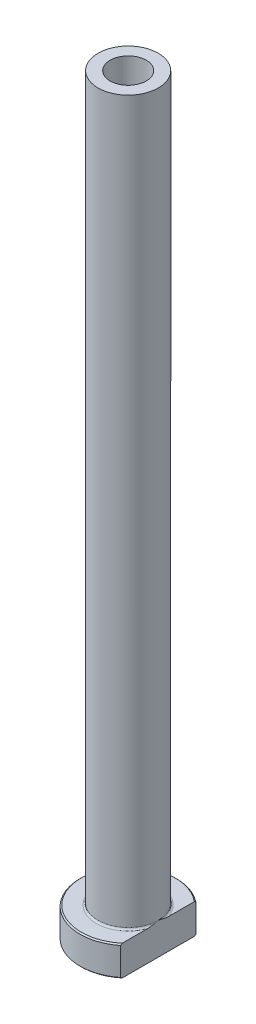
ISO-10303-21;
HEADER;
FILE_DESCRIPTION(('STEP AP214'),'2;1');
FILE_NAME('part.step','',(''),(''),'','','');
FILE_SCHEMA(('AUTOMOTIVE_DESIGN { 1 0 10303 214 1 1 1 1 }'));
ENDSEC;
DATA;
#1=APPLICATION_CONTEXT('core data for automotive mechanical design processes');
#2=APPLICATION_PROTOCOL_DEFINITION('international standard','automotive_design',2000,#1);
#3=PRODUCT_CONTEXT('',#1,'mechanical');
#4=PRODUCT('Part','Part','',(#3));
#5=PRODUCT_RELATED_PRODUCT_CATEGORY('part','',(#4));
#6=PRODUCT_DEFINITION_FORMATION('','',#4);
#7=PRODUCT_DEFINITION_CONTEXT('part definition',#1,'design');
#8=PRODUCT_DEFINITION('design','',#6,#7);
#9=PRODUCT_DEFINITION_SHAPE('','',#8);
#10=(LENGTH_UNIT() NAMED_UNIT(*) SI_UNIT(.MILLI.,.METRE.));
#11=(NAMED_UNIT(*) PLANE_ANGLE_UNIT() SI_UNIT($,.RADIAN.));
#12=(NAMED_UNIT(*) SI_UNIT($,.STERADIAN.) SOLID_ANGLE_UNIT());
#13=UNCERTAINTY_MEASURE_WITH_UNIT(LENGTH_MEASURE(1.E-05),#10,'distance_accuracy_value','');
#14=(GEOMETRIC_REPRESENTATION_CONTEXT(3) GLOBAL_UNCERTAINTY_ASSIGNED_CONTEXT((#13)) GLOBAL_UNIT_ASSIGNED_CONTEXT((#10,
#11,#12)) REPRESENTATION_CONTEXT('',''));
#15=CARTESIAN_POINT('',(0.,0.,0.));
#16=DIRECTION('',(0.,0.,1.));
#17=DIRECTION('',(1.,0.,0.));
#18=AXIS2_PLACEMENT_3D('',#15,#16,#17);
#19=CARTESIAN_POINT('',(0.,92.1876809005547,0.));
#20=DIRECTION('',(0.,1.,0.));
#21=DIRECTION('',(0.,0.,1.));
#22=AXIS2_PLACEMENT_3D('',#19,#20,#21);
#23=CYLINDRICAL_SURFACE('',#22,3.);
#24=CARTESIAN_POINT('',(0.,125.,0.));
#25=DIRECTION('',(0.,1.,0.));
#26=DIRECTION('',(0.,0.,1.));
#27=AXIS2_PLACEMENT_3D('',#24,#25,#26);
#28=CIRCLE('',#27,3.);
#29=CARTESIAN_POINT('',(0.,125.,3.));
#30=VERTEX_POINT('',#29);
#31=EDGE_CURVE('E167',#30,#30,#28,.T.);
#32=ORIENTED_EDGE('',*,*,#31,.T.);
#33=EDGE_LOOP('',(#32));
#34=FACE_BOUND('',#33,.T.);
#35=CARTESIAN_POINT('',(0.,80.,0.));
#36=DIRECTION('',(0.,1.,0.));
#37=DIRECTION('',(0.,0.,1.));
#38=AXIS2_PLACEMENT_3D('',#35,#36,#37);
#39=CIRCLE('',#38,3.);
#40=CARTESIAN_POINT('',(0.,80.,3.));
#41=VERTEX_POINT('',#40);
#42=EDGE_CURVE('E170',#41,#41,#39,.T.);
#43=ORIENTED_EDGE('',*,*,#42,.F.);
#44=EDGE_LOOP('',(#43));
#45=FACE_BOUND('',#44,.T.);
#46=ADVANCED_FACE('F32',(#34,#45),#23,.F.);
#47=CARTESIAN_POINT('',(-3.,125.,0.));
#48=DIRECTION('',(0.,1.,0.));
#49=DIRECTION('',(0.,0.,1.));
#50=AXIS2_PLACEMENT_3D('',#47,#48,#49);
#51=PLANE('',#50);
#52=CARTESIAN_POINT('',(0.,125.,0.));
#53=DIRECTION('',(0.,1.,0.));
#54=DIRECTION('',(0.,0.,1.));
#55=AXIS2_PLACEMENT_3D('',#52,#53,#54);
#56=CIRCLE('',#55,5.);
#57=CARTESIAN_POINT('',(0.,125.,5.));
#58=VERTEX_POINT('',#57);
#59=EDGE_CURVE('E174',#58,#58,#56,.T.);
#60=ORIENTED_EDGE('',*,*,#59,.T.);
#61=EDGE_LOOP('',(#60));
#62=FACE_BOUND('',#61,.T.);
#63=ORIENTED_EDGE('',*,*,#31,.F.);
#64=EDGE_LOOP('',(#63));
#65=FACE_BOUND('',#64,.T.);
#66=ADVANCED_FACE('F157',(#62,#65),#51,.T.);
#67=CARTESIAN_POINT('',(0.,92.1876809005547,0.));
#68=DIRECTION('',(0.,1.,0.));
#69=DIRECTION('',(0.,0.,1.));
#70=AXIS2_PLACEMENT_3D('',#67,#68,#69);
#71=CYLINDRICAL_SURFACE('',#70,5.);
#72=CARTESIAN_POINT('',(0.,5.3,0.));
#73=DIRECTION('',(0.,1.,0.));
#74=DIRECTION('',(0.,0.,1.));
#75=AXIS2_PLACEMENT_3D('',#72,#73,#74);
#76=CIRCLE('',#75,5.);
#77=CARTESIAN_POINT('',(5.,5.3,0.));
#78=VERTEX_POINT('',#77);
#79=EDGE_CURVE('E180',#78,#78,#76,.T.);
#80=ORIENTED_EDGE('',*,*,#79,.T.);
#81=EDGE_LOOP('',(#80));
#82=FACE_BOUND('',#81,.T.);
#83=ORIENTED_EDGE('',*,*,#59,.F.);
#84=EDGE_LOOP('',(#83));
#85=FACE_BOUND('',#84,.T.);
#86=ADVANCED_FACE('F162',(#82,#85),#71,.T.);
#87=CARTESIAN_POINT('',(-4.99999999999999,5.,0.));
#88=DIRECTION('',(0.,1.,0.));
#89=DIRECTION('',(0.,0.,1.));
#90=AXIS2_PLACEMENT_3D('',#87,#88,#89);
#91=PLANE('',#90);
#92=DIRECTION('',(0.,0.,1.));
#93=VECTOR('',#92,1.);
#94=CARTESIAN_POINT('',(5.,5.,0.));
#95=LINE('',#94,#93);
#96=CARTESIAN_POINT('',(5.,5.,-5.9866518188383));
#97=VERTEX_POINT('',#96);
#98=CARTESIAN_POINT('',(5.,5.,-1.7578395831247));
#99=VERTEX_POINT('',#98);
#100=EDGE_CURVE('E54',#97,#99,#95,.T.);
#101=ORIENTED_EDGE('',*,*,#100,.F.);
#102=CARTESIAN_POINT('',(0.,5.,0.));
#103=DIRECTION('',(0.,1.,0.));
#104=DIRECTION('',(0.,0.,1.));
#105=AXIS2_PLACEMENT_3D('',#102,#103,#104);
#106=CIRCLE('',#105,7.79999999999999);
#107=CARTESIAN_POINT('',(4.99999999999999,5.,5.9866518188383));
#108=VERTEX_POINT('',#107);
#109=EDGE_CURVE('E186',#97,#108,#106,.T.);
#110=ORIENTED_EDGE('',*,*,#109,.T.);
#111=CARTESIAN_POINT('',(5.,5.,1.7578395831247));
#112=VERTEX_POINT('',#111);
#113=EDGE_CURVE('E134',#112,#108,#95,.T.);
#114=ORIENTED_EDGE('',*,*,#113,.F.);
#115=CARTESIAN_POINT('',(0.,5.,0.));
#116=DIRECTION('',(0.,1.,0.));
#117=DIRECTION('',(0.,0.,1.));
#118=AXIS2_PLACEMENT_3D('',#115,#116,#117);
#119=CIRCLE('',#118,5.3);
#120=EDGE_CURVE('E183',#112,#99,#119,.F.);
#121=ORIENTED_EDGE('',*,*,#120,.T.);
#122=EDGE_LOOP('',(#101,#110,#114,#121));
#123=FACE_BOUND('',#122,.T.);
#124=ADVANCED_FACE('F197',(#123),#91,.T.);
#125=CARTESIAN_POINT('',(0.,92.1876809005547,0.));
#126=DIRECTION('',(0.,1.,0.));
#127=DIRECTION('',(0.,0.,1.));
#128=AXIS2_PLACEMENT_3D('',#125,#126,#127);
#129=CYLINDRICAL_SURFACE('',#128,7.99999999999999);
#130=DIRECTION('',(0.,-1.,0.));
#131=VECTOR('',#130,1.);
#132=CARTESIAN_POINT('',(4.99999999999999,125.,6.24499799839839));
#133=LINE('',#132,#131);
#134=CARTESIAN_POINT('',(4.99999999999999,4.8,6.24499799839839));
#135=VERTEX_POINT('',#134);
#136=CARTESIAN_POINT('',(4.99999999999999,0.20000000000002,6.24499799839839));
#137=VERTEX_POINT('',#136);
#138=EDGE_CURVE('E82',#135,#137,#133,.T.);
#139=ORIENTED_EDGE('',*,*,#138,.F.);
#140=CARTESIAN_POINT('',(0.,4.8,0.));
#141=DIRECTION('',(0.,1.,0.));
#142=DIRECTION('',(0.,0.,1.));
#143=AXIS2_PLACEMENT_3D('',#140,#141,#142);
#144=CIRCLE('',#143,7.99999999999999);
#145=CARTESIAN_POINT('',(5.,4.8,-6.24499799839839));
#146=VERTEX_POINT('',#145);
#147=EDGE_CURVE('E95',#135,#146,#144,.F.);
#148=ORIENTED_EDGE('',*,*,#147,.T.);
#149=DIRECTION('',(0.,-1.,0.));
#150=VECTOR('',#149,1.);
#151=CARTESIAN_POINT('',(5.,125.,-6.24499799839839));
#152=LINE('',#151,#150);
#153=CARTESIAN_POINT('',(5.,0.20000000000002,-6.24499799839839));
#154=VERTEX_POINT('',#153);
#155=EDGE_CURVE('E192',#146,#154,#152,.T.);
#156=ORIENTED_EDGE('',*,*,#155,.T.);
#157=CARTESIAN_POINT('',(0.,0.20000000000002,0.));
#158=DIRECTION('',(0.,-1.,0.));
#159=DIRECTION('',(0.,0.,-1.));
#160=AXIS2_PLACEMENT_3D('',#157,#158,#159);
#161=CIRCLE('',#160,7.99999999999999);
#162=EDGE_CURVE('E98',#154,#137,#161,.F.);
#163=ORIENTED_EDGE('',*,*,#162,.T.);
#164=EDGE_LOOP('',(#139,#148,#156,#163));
#165=FACE_BOUND('',#164,.T.);
#166=ADVANCED_FACE('F190',(#165),#129,.T.);
#167=CARTESIAN_POINT('',(-7.99999999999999,0.,0.));
#168=DIRECTION('',(0.,-1.,0.));
#169=DIRECTION('',(0.,0.,-1.));
#170=AXIS2_PLACEMENT_3D('',#167,#168,#169);
#171=PLANE('',#170);
#172=CARTESIAN_POINT('',(0.,0.,0.));
#173=DIRECTION('',(0.,-1.,0.));
#174=DIRECTION('',(0.,0.,-1.));
#175=AXIS2_PLACEMENT_3D('',#172,#173,#174);
#176=CIRCLE('',#175,3.74999999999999);
#177=CARTESIAN_POINT('',(0.,0.,-3.74999999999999));
#178=VERTEX_POINT('',#177);
#179=EDGE_CURVE('E40',#178,#178,#176,.F.);
#180=ORIENTED_EDGE('',*,*,#179,.T.);
#181=EDGE_LOOP('',(#180));
#182=FACE_BOUND('',#181,.T.);
#183=DIRECTION('',(0.,0.,-1.));
#184=VECTOR('',#183,1.);
#185=CARTESIAN_POINT('',(4.99999999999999,0.,6.24499799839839));
#186=LINE('',#185,#184);
#187=CARTESIAN_POINT('',(4.99999999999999,0.,5.98665181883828));
#188=VERTEX_POINT('',#187);
#189=CARTESIAN_POINT('',(5.,0.,-5.98665181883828));
#190=VERTEX_POINT('',#189);
#191=EDGE_CURVE('E47',#188,#190,#186,.T.);
#192=ORIENTED_EDGE('',*,*,#191,.F.);
#193=CARTESIAN_POINT('',(0.,0.,0.));
#194=DIRECTION('',(0.,-1.,0.));
#195=DIRECTION('',(0.,0.,-1.));
#196=AXIS2_PLACEMENT_3D('',#193,#194,#195);
#197=CIRCLE('',#196,7.79999999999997);
#198=EDGE_CURVE('E92',#188,#190,#197,.T.);
#199=ORIENTED_EDGE('',*,*,#198,.T.);
#200=EDGE_LOOP('',(#192,#199));
#201=FACE_BOUND('',#200,.T.);
#202=ADVANCED_FACE('F91',(#182,#201),#171,.T.);
#203=CARTESIAN_POINT('',(0.,92.1876809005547,0.));
#204=DIRECTION('',(0.,1.,0.));
#205=DIRECTION('',(0.,0.,1.));
#206=AXIS2_PLACEMENT_3D('',#203,#204,#205);
#207=CYLINDRICAL_SURFACE('',#206,3.24999999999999);
#208=CARTESIAN_POINT('',(0.,0.5,0.));
#209=DIRECTION('',(0.,-1.,0.));
#210=DIRECTION('',(0.,0.,-1.));
#211=AXIS2_PLACEMENT_3D('',#208,#209,#210);
#212=CIRCLE('',#211,3.24999999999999);
#213=CARTESIAN_POINT('',(0.,0.5,-3.24999999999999));
#214=VERTEX_POINT('',#213);
#215=EDGE_CURVE('E11',#214,#214,#212,.T.);
#216=ORIENTED_EDGE('',*,*,#215,.T.);
#217=EDGE_LOOP('',(#216));
#218=FACE_BOUND('',#217,.T.);
#219=CARTESIAN_POINT('',(0.,68.,0.));
#220=DIRECTION('',(0.,1.,0.));
#221=DIRECTION('',(0.,0.,1.));
#222=AXIS2_PLACEMENT_3D('',#219,#220,#221);
#223=CIRCLE('',#222,3.25);
#224=CARTESIAN_POINT('',(0.,68.,3.25));
#225=VERTEX_POINT('',#224);
#226=EDGE_CURVE('E172',#225,#225,#223,.T.);
#227=ORIENTED_EDGE('',*,*,#226,.T.);
#228=EDGE_LOOP('',(#227));
#229=FACE_BOUND('',#228,.T.);
#230=ADVANCED_FACE('F215',(#218,#229),#207,.F.);
#231=CARTESIAN_POINT('',(0.,68.,0.));
#232=DIRECTION('',(0.,-1.,0.));
#233=DIRECTION('',(0.,0.,-1.));
#234=AXIS2_PLACEMENT_3D('',#231,#232,#233);
#235=CONICAL_SURFACE('',#234,3.25,0.0208303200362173);
#236=ORIENTED_EDGE('',*,*,#42,.T.);
#237=EDGE_LOOP('',(#236));
#238=FACE_BOUND('',#237,.T.);
#239=ORIENTED_EDGE('',*,*,#226,.F.);
#240=EDGE_LOOP('',(#239));
#241=FACE_BOUND('',#240,.T.);
#242=ADVANCED_FACE('F111',(#238,#241),#235,.F.);
#243=CARTESIAN_POINT('',(0.,5.3,0.));
#244=DIRECTION('',(0.,1.,0.));
#245=DIRECTION('',(0.,0.,1.));
#246=AXIS2_PLACEMENT_3D('',#243,#244,#245);
#247=TOROIDAL_SURFACE('',#246,5.3,0.3);
#248=ORIENTED_EDGE('',*,*,#120,.F.);
#249=CARTESIAN_POINT('',(5.,5.3,0.));
#250=CARTESIAN_POINT('',(5.,5.30000062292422,-1.31469087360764E-10));
#251=CARTESIAN_POINT('',(5.,5.30000124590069,2.52759255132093E-07));
#252=CARTESIAN_POINT('',(5.,5.30000240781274,9.47164419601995E-07));
#253=CARTESIAN_POINT('',(5.,5.30000293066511,1.40594046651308E-06));
#254=CARTESIAN_POINT('',(5.,5.30000402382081,2.50637618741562E-06));
#255=CARTESIAN_POINT('',(5.,5.30000457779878,3.16588923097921E-06));
#256=CARTESIAN_POINT('',(5.,5.3000055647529,4.52859982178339E-06));
#257=CARTESIAN_POINT('',(5.,5.30000600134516,5.22939463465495E-06));
#258=CARTESIAN_POINT('',(5.,5.30000763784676,7.96122010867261E-06));
#259=CARTESIAN_POINT('',(5.,5.30000875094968,1.00477412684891E-05));
#260=CARTESIAN_POINT('',(5.,5.30001056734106,1.41660877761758E-05));
#261=CARTESIAN_POINT('',(5.,5.30001129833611,1.61861787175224E-05));
#262=CARTESIAN_POINT('',(5.,5.30001439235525,2.47865746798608E-05));
#263=CARTESIAN_POINT('',(5.,5.30001672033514,3.13830291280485E-05));
#264=CARTESIAN_POINT('',(5.,5.30002012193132,4.38084229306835E-05));
#265=CARTESIAN_POINT('',(5.,5.3000213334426,4.95992746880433E-05));
#266=CARTESIAN_POINT('',(5.,5.30003020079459,9.27862626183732E-05));
#267=CARTESIAN_POINT('',(5.,5.30003696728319,0.00013030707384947));
#268=CARTESIAN_POINT('',(5.,5.30006659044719,0.000278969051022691));
#269=CARTESIAN_POINT('',(5.,5.30009481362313,0.000389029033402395));
#270=CARTESIAN_POINT('',(5.,5.30020506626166,0.000826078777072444));
#271=CARTESIAN_POINT('',(5.,5.30028365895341,0.00115365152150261));
#272=CARTESIAN_POINT('',(5.,5.30059919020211,0.00245925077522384));
#273=CARTESIAN_POINT('',(5.,5.30084048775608,0.00343651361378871));
#274=CARTESIAN_POINT('',(5.,5.30184626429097,0.00752058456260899));
#275=CARTESIAN_POINT('',(5.,5.30260525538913,0.0106283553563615));
#276=CARTESIAN_POINT('',(5.,5.3099646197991,0.0407482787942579));
#277=CARTESIAN_POINT('',(5.,5.31658985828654,0.0677561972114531));
#278=CARTESIAN_POINT('',(5.,5.32953319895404,0.120688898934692));
#279=CARTESIAN_POINT('',(5.,5.33585289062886,0.146613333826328));
#280=CARTESIAN_POINT('',(5.,5.34926050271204,0.20179565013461));
#281=CARTESIAN_POINT('',(5.,5.35634306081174,0.23105486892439));
#282=CARTESIAN_POINT('',(5.,5.37050252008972,0.289917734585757));
#283=CARTESIAN_POINT('',(5.,5.37757848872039,0.319521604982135));
#284=CARTESIAN_POINT('',(5.,5.39452602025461,0.391032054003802));
#285=CARTESIAN_POINT('',(5.,5.40434071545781,0.432952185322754));
#286=CARTESIAN_POINT('',(5.,5.42340141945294,0.515763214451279));
#287=CARTESIAN_POINT('',(5.,5.43265559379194,0.556652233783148));
#288=CARTESIAN_POINT('',(5.,5.45710553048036,0.667075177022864));
#289=CARTESIAN_POINT('',(5.,5.47194176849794,0.736689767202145));
#290=CARTESIAN_POINT('',(5.,5.5001822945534,0.876836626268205));
#291=CARTESIAN_POINT('',(5.,5.51357312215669,0.947371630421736));
#292=CARTESIAN_POINT('',(5.,5.53930921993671,1.09497328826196));
#293=CARTESIAN_POINT('',(5.,5.55146217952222,1.17207432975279));
#294=CARTESIAN_POINT('',(5.,5.57239669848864,1.32672649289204));
#295=CARTESIAN_POINT('',(5.,5.58117877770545,1.40427754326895));
#296=CARTESIAN_POINT('',(5.,5.59499725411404,1.5687382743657));
#297=CARTESIAN_POINT('',(5.,5.59948802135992,1.65570044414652));
#298=CARTESIAN_POINT('',(5.,5.60018885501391,1.7853530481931));
#299=CARTESIAN_POINT('',(5.,5.5994521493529,1.82802575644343));
#300=CARTESIAN_POINT('',(5.,5.59559364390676,1.91325081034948));
#301=CARTESIAN_POINT('',(5.,5.59247319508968,1.95580321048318));
#302=CARTESIAN_POINT('',(5.,5.58383242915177,2.03512365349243));
#303=CARTESIAN_POINT('',(5.,5.57867386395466,2.07192937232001));
#304=CARTESIAN_POINT('',(5.,5.56543793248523,2.14526756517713));
#305=CARTESIAN_POINT('',(5.,5.55734203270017,2.18179676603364));
#306=CARTESIAN_POINT('',(5.,5.53718005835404,2.25427226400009));
#307=CARTESIAN_POINT('',(5.,5.5250705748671,2.29020746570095));
#308=CARTESIAN_POINT('',(5.,5.50270928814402,2.34223029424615));
#309=CARTESIAN_POINT('',(5.,5.49457811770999,2.35922314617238));
#310=CARTESIAN_POINT('',(5.,5.47657809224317,2.39224900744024));
#311=CARTESIAN_POINT('',(5.,5.46671281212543,2.40828390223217));
#312=CARTESIAN_POINT('',(5.,5.44695893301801,2.43579467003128));
#313=CARTESIAN_POINT('',(5.,5.43745879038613,2.4475459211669));
#314=CARTESIAN_POINT('',(5.,5.41677914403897,2.4694647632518));
#315=CARTESIAN_POINT('',(5.,5.40560543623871,2.47963758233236));
#316=CARTESIAN_POINT('',(5.,5.38617750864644,2.49393642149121));
#317=CARTESIAN_POINT('',(5.,5.37851643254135,2.49886271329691));
#318=CARTESIAN_POINT('',(5.,5.36252740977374,2.50749953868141));
#319=CARTESIAN_POINT('',(5.,5.35419984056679,2.51121075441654));
#320=CARTESIAN_POINT('',(5.,5.33690648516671,2.51712941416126));
#321=CARTESIAN_POINT('',(5.,5.32793451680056,2.51931927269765));
#322=CARTESIAN_POINT('',(5.,5.30973576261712,2.52185978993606));
#323=CARTESIAN_POINT('',(5.,5.30050931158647,2.52221275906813));
#324=CARTESIAN_POINT('',(5.,5.28349166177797,2.52112455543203));
#325=CARTESIAN_POINT('',(5.,5.27568322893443,2.51993178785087));
#326=CARTESIAN_POINT('',(5.,5.26036860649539,2.5162829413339));
#327=CARTESIAN_POINT('',(5.,5.25286261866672,2.51382603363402));
#328=CARTESIAN_POINT('',(5.,5.23590266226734,2.50685484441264));
#329=CARTESIAN_POINT('',(5.,5.22661875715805,2.501929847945));
#330=CARTESIAN_POINT('',(5.,5.20895514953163,2.49066548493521));
#331=CARTESIAN_POINT('',(5.,5.20057756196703,2.48432291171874));
#332=CARTESIAN_POINT('',(5.,5.17987008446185,2.46645212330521));
#333=CARTESIAN_POINT('',(5.,5.16824151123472,2.45411867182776));
#334=CARTESIAN_POINT('',(5.,5.1469246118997,2.42790849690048));
#335=CARTESIAN_POINT('',(5.,5.1372398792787,2.4140289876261));
#336=CARTESIAN_POINT('',(5.,5.11080706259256,2.37143175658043));
#337=CARTESIAN_POINT('',(5.,5.0962877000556,2.34134703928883));
#338=CARTESIAN_POINT('',(5.,5.07130349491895,2.27940731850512));
#339=CARTESIAN_POINT('',(5.,5.0608711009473,2.24754035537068));
#340=CARTESIAN_POINT('',(5.,5.03890359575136,2.1678724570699));
#341=CARTESIAN_POINT('',(5.,5.02913523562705,2.1195906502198));
#342=CARTESIAN_POINT('',(5.,5.01416953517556,2.02224928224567));
#343=CARTESIAN_POINT('',(5.,5.00898637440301,1.97318778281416));
#344=CARTESIAN_POINT('',(5.,5.00220823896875,1.87635767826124));
#345=CARTESIAN_POINT('',(5.,5.00050709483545,1.82859609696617));
#346=CARTESIAN_POINT('',(5.,4.99969104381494,1.73330165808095));
#347=CARTESIAN_POINT('',(5.,5.00056327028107,1.68576884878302));
#348=CARTESIAN_POINT('',(5.,5.00484296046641,1.57937770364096));
#349=CARTESIAN_POINT('',(5.,5.00880932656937,1.5205428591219));
#350=CARTESIAN_POINT('',(5.,5.0192596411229,1.40312974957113));
#351=CARTESIAN_POINT('',(5.,5.02574264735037,1.34455139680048));
#352=CARTESIAN_POINT('',(5.,5.04090087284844,1.22627662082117));
#353=CARTESIAN_POINT('',(5.,5.04962425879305,1.16658647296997));
#354=CARTESIAN_POINT('',(5.,5.06877923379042,1.0473246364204));
#355=CARTESIAN_POINT('',(5.,5.07921523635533,0.987753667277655));
#356=CARTESIAN_POINT('',(5.,5.10551698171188,0.846936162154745));
#357=CARTESIAN_POINT('',(5.,5.12196565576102,0.765799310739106));
#358=CARTESIAN_POINT('',(5.,5.15639716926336,0.604819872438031));
#359=CARTESIAN_POINT('',(5.,5.17436050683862,0.524973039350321));
#360=CARTESIAN_POINT('',(5.,5.20921667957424,0.374726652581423));
#361=CARTESIAN_POINT('',(4.99999999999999,5.22599388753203,0.304300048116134));
#362=CARTESIAN_POINT('',(5.,5.2519110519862,0.196907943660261));
#363=CARTESIAN_POINT('',(5.,5.26090146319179,0.159905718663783));
#364=CARTESIAN_POINT('',(4.99999999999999,5.27881854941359,0.0865164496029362));
#365=CARTESIAN_POINT('',(4.99999999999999,5.28774391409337,0.0501291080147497));
#366=CARTESIAN_POINT('',(5.,5.29739627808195,0.0106218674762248));
#367=CARTESIAN_POINT('',(5.,5.2981568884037,0.0075076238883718));
#368=CARTESIAN_POINT('',(5.,5.29916304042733,0.00342209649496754));
#369=CARTESIAN_POINT('',(4.99999999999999,5.29940309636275,0.00244985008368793));
#370=CARTESIAN_POINT('',(5.,5.29971711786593,0.00115049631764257));
#371=CARTESIAN_POINT('',(5.,5.29979541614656,0.000824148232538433));
#372=CARTESIAN_POINT('',(5.,5.29990531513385,0.000388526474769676));
#373=CARTESIAN_POINT('',(5.,5.29993348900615,0.000278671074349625));
#374=CARTESIAN_POINT('',(5.,5.29996306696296,0.000130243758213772));
#375=CARTESIAN_POINT('',(5.,5.29996982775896,9.27511390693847E-05));
#376=CARTESIAN_POINT('',(5.,5.29997868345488,4.9592989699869E-05));
#377=CARTESIAN_POINT('',(5.,5.29997989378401,4.38036564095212E-05));
#378=CARTESIAN_POINT('',(5.,5.29998329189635,3.138141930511E-05));
#379=CARTESIAN_POINT('',(5.,5.29998561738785,2.4786522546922E-05));
#380=CARTESIAN_POINT('',(5.,5.29998870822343,1.61877550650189E-05));
#381=CARTESIAN_POINT('',(5.,5.29998943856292,1.4167777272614E-05));
#382=CARTESIAN_POINT('',(5.,5.2999912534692,1.00495534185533E-05));
#383=CARTESIAN_POINT('',(5.,5.2999923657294,7.96302685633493E-06));
#384=CARTESIAN_POINT('',(5.,5.29999400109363,5.23107434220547E-06));
#385=CARTESIAN_POINT('',(5.,5.29999443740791,4.5302105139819E-06));
#386=CARTESIAN_POINT('',(5.,5.29999542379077,3.16731170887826E-06));
#387=CARTESIAN_POINT('',(5.,5.299995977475,2.50767739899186E-06));
#388=CARTESIAN_POINT('',(5.,5.2999970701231,1.40695888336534E-06));
#389=CARTESIAN_POINT('',(5.,5.29999759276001,9.48032525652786E-07));
#390=CARTESIAN_POINT('',(5.,5.29999875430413,2.53244363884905E-07));
#391=CARTESIAN_POINT('',(5.,5.29999937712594,1.31459889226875E-10));
#392=CARTESIAN_POINT('',(5.,5.3,0.));
#393=B_SPLINE_CURVE_WITH_KNOTS('',3,(#249,#250,#251,#252,#253,#254,#255,#256,#257,#258,#259,
#260,#261,#262,#263,#264,#265,#266,#267,#268,#269,#270,#271,#272,#273,#274,#275,#276,#277,#278,
#279,#280,#281,#282,#283,#284,#285,#286,#287,#288,#289,#290,#291,#292,#293,#294,#295,#296,#297,
#298,#299,#300,#301,#302,#303,#304,#305,#306,#307,#308,#309,#310,#311,#312,#313,#314,#315,#316,
#317,#318,#319,#320,#321,#322,#323,#324,#325,#326,#327,#328,#329,#330,#331,#332,#333,#334,#335,
#336,#337,#338,#339,#340,#341,#342,#343,#344,#345,#346,#347,#348,#349,#350,#351,#352,#353,#354,
#355,#356,#357,#358,#359,#360,#361,#362,#363,#364,#365,#366,#367,#368,#369,#370,#371,#372,#373,
#374,#375,#376,#377,#378,#379,#380,#381,#382,#383,#384,#385,#386,#387,#388,#389,#390,#391,#392),
.UNSPECIFIED.,.T.,.F.,(4,2,2,2,2,2,2,2,2,2,2,2,2,2,2,2,2,2,2,2,2,2,2,2,2,2,2,2,2,2,2,2,2,2,2,2,
2,2,2,2,2,2,2,2,2,2,2,2,2,2,2,2,2,2,2,2,2,2,2,2,2,2,2,2,2,2,2,2,2,2,2,4),(0.,
1.88939263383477E-06,3.98058820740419E-06,6.54818442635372E-06,9.02404238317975E-06,
1.60938732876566E-05,2.25328176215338E-05,4.34843900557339E-05,6.12120172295E-05,
0.000175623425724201,0.000516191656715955,0.00152710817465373,0.00454656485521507,
0.0141443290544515,0.0975679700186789,0.177619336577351,0.267931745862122,0.35924502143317,
0.488405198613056,0.614173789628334,0.827694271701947,1.04305715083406,1.27715608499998,
1.51121890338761,1.77214751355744,1.90013509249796,2.02805018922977,2.13945459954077,
2.25157451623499,2.36494894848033,2.42139235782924,2.47772074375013,2.52293802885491,
2.56800219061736,2.59524342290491,2.62246933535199,2.65000494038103,2.67750590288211,
2.70108948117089,2.72468854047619,2.7560397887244,2.78746268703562,2.838028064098,
2.88868607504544,2.98834295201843,3.08877575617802,3.23618650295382,3.38405153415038,
3.52733651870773,3.66990630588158,3.84673903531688,4.02350562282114,4.20444776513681,
4.38586374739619,4.63419556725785,4.87971270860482,5.09690175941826,5.21113882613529,
5.32353360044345,5.33315137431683,5.33615533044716,5.33716246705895,5.33750240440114,
5.33761672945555,5.33763445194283,5.3376553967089,5.33766183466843,5.33766890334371,
5.33767137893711,5.33767394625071,5.33767603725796,5.33767792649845),.UNSPECIFIED.);
#394=EDGE_CURVE('E126',#112,#78,#393,.T.);
#395=ORIENTED_EDGE('',*,*,#394,.T.);
#396=ORIENTED_EDGE('',*,*,#79,.F.);
#397=CARTESIAN_POINT('',(5.,5.3,0.));
#398=CARTESIAN_POINT('',(5.,5.29999937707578,1.31470461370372E-10));
#399=CARTESIAN_POINT('',(5.,5.29999875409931,-2.52759253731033E-07));
#400=CARTESIAN_POINT('',(5.,5.29999759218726,-9.47164418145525E-07));
#401=CARTESIAN_POINT('',(5.,5.29999706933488,-1.40594046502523E-06));
#402=CARTESIAN_POINT('',(5.,5.29999597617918,-2.50637618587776E-06));
#403=CARTESIAN_POINT('',(5.,5.29999542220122,-3.16588922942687E-06));
#404=CARTESIAN_POINT('',(5.,5.2999944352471,-4.52859982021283E-06));
#405=CARTESIAN_POINT('',(5.,5.29999399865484,-5.22939463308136E-06));
#406=CARTESIAN_POINT('',(5.,5.29999236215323,-7.96122010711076E-06));
#407=CARTESIAN_POINT('',(5.,5.29999124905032,-1.00477412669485E-05));
#408=CARTESIAN_POINT('',(5.,5.29998943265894,-1.41660877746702E-05));
#409=CARTESIAN_POINT('',(5.,5.29998870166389,-1.61861787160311E-05));
#410=CARTESIAN_POINT('',(5.,5.29998560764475,-2.47865746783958E-05));
#411=CARTESIAN_POINT('',(5.,5.29998327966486,-3.13830291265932E-05));
#412=CARTESIAN_POINT('',(5.,5.29997987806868,-4.38084229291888E-05));
#413=CARTESIAN_POINT('',(5.,5.2999786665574,-4.95992746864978E-05));
#414=CARTESIAN_POINT('',(5.,5.29996979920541,-9.27862626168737E-05));
#415=CARTESIAN_POINT('',(5.,5.2999630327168,-0.000130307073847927));
#416=CARTESIAN_POINT('',(5.,5.2999334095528,-0.000278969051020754));
#417=CARTESIAN_POINT('',(5.,5.29990518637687,-0.000389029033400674));
#418=CARTESIAN_POINT('',(5.,5.29979493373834,-0.000826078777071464));
#419=CARTESIAN_POINT('',(5.,5.29971634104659,-0.00115365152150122));
#420=CARTESIAN_POINT('',(5.,5.29940080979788,-0.00245925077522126));
#421=CARTESIAN_POINT('',(5.,5.29915951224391,-0.00343651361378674));
#422=CARTESIAN_POINT('',(5.,5.29815373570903,-0.00752058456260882));
#423=CARTESIAN_POINT('',(5.,5.29739474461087,-0.0106283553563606));
#424=CARTESIAN_POINT('',(5.,5.29003538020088,-0.0407482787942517));
#425=CARTESIAN_POINT('',(5.,5.28341014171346,-0.0677561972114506));
#426=CARTESIAN_POINT('',(5.,5.27046680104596,-0.120688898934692));
#427=CARTESIAN_POINT('',(5.,5.26414710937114,-0.146613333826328));
#428=CARTESIAN_POINT('',(5.,5.25073949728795,-0.201795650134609));
#429=CARTESIAN_POINT('',(5.,5.24365693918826,-0.231054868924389));
#430=CARTESIAN_POINT('',(5.,5.22949747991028,-0.289917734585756));
#431=CARTESIAN_POINT('',(5.,5.22242151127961,-0.319521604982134));
#432=CARTESIAN_POINT('',(5.,5.20547397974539,-0.391032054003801));
#433=CARTESIAN_POINT('',(5.,5.19565928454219,-0.432952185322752));
#434=CARTESIAN_POINT('',(5.,5.17659858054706,-0.515763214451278));
#435=CARTESIAN_POINT('',(5.,5.16734440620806,-0.556652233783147));
#436=CARTESIAN_POINT('',(5.,5.14289446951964,-0.667075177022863));
#437=CARTESIAN_POINT('',(5.,5.12805823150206,-0.736689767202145));
#438=CARTESIAN_POINT('',(5.,5.0998177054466,-0.876836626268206));
#439=CARTESIAN_POINT('',(5.,5.08642687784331,-0.947371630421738));
#440=CARTESIAN_POINT('',(5.,5.06069078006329,-1.09497328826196));
#441=CARTESIAN_POINT('',(5.,5.04853782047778,-1.17207432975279));
#442=CARTESIAN_POINT('',(5.,5.02760330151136,-1.32672649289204));
#443=CARTESIAN_POINT('',(5.,5.01882122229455,-1.40427754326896));
#444=CARTESIAN_POINT('',(5.,5.00500274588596,-1.5687382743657));
#445=CARTESIAN_POINT('',(5.,5.00051197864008,-1.65570044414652));
#446=CARTESIAN_POINT('',(5.,4.99981114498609,-1.78535304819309));
#447=CARTESIAN_POINT('',(5.,5.0005478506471,-1.82802575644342));
#448=CARTESIAN_POINT('',(5.,5.00440635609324,-1.91325081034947));
#449=CARTESIAN_POINT('',(5.,5.00752680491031,-1.95580321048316));
#450=CARTESIAN_POINT('',(5.,5.01616757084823,-2.03512365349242));
#451=CARTESIAN_POINT('',(5.,5.02132613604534,-2.07192937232));
#452=CARTESIAN_POINT('',(5.,5.03456206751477,-2.14526756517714));
#453=CARTESIAN_POINT('',(5.,5.04265796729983,-2.18179676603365));
#454=CARTESIAN_POINT('',(5.,5.06281994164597,-2.25427226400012));
#455=CARTESIAN_POINT('',(5.,5.07492942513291,-2.29020746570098));
#456=CARTESIAN_POINT('',(5.,5.097290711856,-2.34223029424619));
#457=CARTESIAN_POINT('',(5.,5.10542188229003,-2.35922314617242));
#458=CARTESIAN_POINT('',(5.,5.12342190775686,-2.39224900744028));
#459=CARTESIAN_POINT('',(5.,5.1332871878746,-2.40828390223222));
#460=CARTESIAN_POINT('',(5.,5.15304106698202,-2.43579467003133));
#461=CARTESIAN_POINT('',(5.,5.16254120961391,-2.44754592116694));
#462=CARTESIAN_POINT('',(5.,5.18322085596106,-2.46946476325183));
#463=CARTESIAN_POINT('',(5.,5.19439456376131,-2.47963758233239));
#464=CARTESIAN_POINT('',(5.,5.21382249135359,-2.49393642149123));
#465=CARTESIAN_POINT('',(5.,5.22148356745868,-2.49886271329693));
#466=CARTESIAN_POINT('',(5.,5.23747259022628,-2.50749953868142));
#467=CARTESIAN_POINT('',(5.,5.24580015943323,-2.51121075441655));
#468=CARTESIAN_POINT('',(5.,5.26309351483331,-2.51712941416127));
#469=CARTESIAN_POINT('',(5.,5.27206548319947,-2.51931927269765));
#470=CARTESIAN_POINT('',(5.,5.2902642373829,-2.52185978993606));
#471=CARTESIAN_POINT('',(5.,5.29949068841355,-2.52221275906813));
#472=CARTESIAN_POINT('',(5.,5.31650833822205,-2.52112455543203));
#473=CARTESIAN_POINT('',(5.,5.32431677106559,-2.51993178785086));
#474=CARTESIAN_POINT('',(5.,5.33963139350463,-2.5162829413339));
#475=CARTESIAN_POINT('',(5.,5.3471373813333,-2.51382603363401));
#476=CARTESIAN_POINT('',(5.,5.36409733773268,-2.50685484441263));
#477=CARTESIAN_POINT('',(5.,5.37338124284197,-2.50192984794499));
#478=CARTESIAN_POINT('',(5.,5.39104485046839,-2.49066548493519));
#479=CARTESIAN_POINT('',(5.,5.39942243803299,-2.48432291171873));
#480=CARTESIAN_POINT('',(5.,5.42012991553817,-2.46645212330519));
#481=CARTESIAN_POINT('',(5.,5.4317584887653,-2.45411867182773));
#482=CARTESIAN_POINT('',(5.,5.45307538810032,-2.42790849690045));
#483=CARTESIAN_POINT('',(5.,5.46276012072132,-2.41402898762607));
#484=CARTESIAN_POINT('',(5.,5.48919293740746,-2.37143175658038));
#485=CARTESIAN_POINT('',(5.,5.50371229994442,-2.34134703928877));
#486=CARTESIAN_POINT('',(5.,5.52869650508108,-2.27940731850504));
#487=CARTESIAN_POINT('',(5.,5.53912889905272,-2.24754035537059));
#488=CARTESIAN_POINT('',(5.,5.56109640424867,-2.16787245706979));
#489=CARTESIAN_POINT('',(5.,5.57086476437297,-2.11959065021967));
#490=CARTESIAN_POINT('',(5.,5.58583046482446,-2.02224928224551));
#491=CARTESIAN_POINT('',(5.,5.59101362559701,-1.97318778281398));
#492=CARTESIAN_POINT('',(5.,5.59779176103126,-1.87635767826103));
#493=CARTESIAN_POINT('',(5.,5.59949290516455,-1.82859609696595));
#494=CARTESIAN_POINT('',(5.,5.60030895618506,-1.7333016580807));
#495=CARTESIAN_POINT('',(5.,5.59943672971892,-1.68576884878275));
#496=CARTESIAN_POINT('',(5.,5.59515703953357,-1.57937770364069));
#497=CARTESIAN_POINT('',(5.,5.59119067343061,-1.52054285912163));
#498=CARTESIAN_POINT('',(5.,5.58074035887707,-1.40312974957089));
#499=CARTESIAN_POINT('',(5.,5.5742573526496,-1.34455139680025));
#500=CARTESIAN_POINT('',(5.,5.55909912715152,-1.22627662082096));
#501=CARTESIAN_POINT('',(5.,5.55037574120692,-1.16658647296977));
#502=CARTESIAN_POINT('',(5.,5.53122076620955,-1.04732463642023));
#503=CARTESIAN_POINT('',(5.,5.52078476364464,-0.987753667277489));
#504=CARTESIAN_POINT('',(5.,5.49448301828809,-0.846936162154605));
#505=CARTESIAN_POINT('',(5.,5.47803434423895,-0.76579931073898));
#506=CARTESIAN_POINT('',(5.,5.44360283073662,-0.604819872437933));
#507=CARTESIAN_POINT('',(5.,5.42563949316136,-0.524973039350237));
#508=CARTESIAN_POINT('',(5.,5.39078332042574,-0.374726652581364));
#509=CARTESIAN_POINT('',(5.,5.37400611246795,-0.304300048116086));
#510=CARTESIAN_POINT('',(5.,5.3480889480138,-0.196907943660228));
#511=CARTESIAN_POINT('',(5.,5.33909853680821,-0.159905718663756));
#512=CARTESIAN_POINT('',(5.,5.3211814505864,-0.0865164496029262));
#513=CARTESIAN_POINT('',(5.,5.31225608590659,-0.050129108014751));
#514=CARTESIAN_POINT('',(5.,5.30260372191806,-0.0106218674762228));
#515=CARTESIAN_POINT('',(5.,5.3018431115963,-0.00750762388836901));
#516=CARTESIAN_POINT('',(5.,5.30083695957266,-0.00342209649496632));
#517=CARTESIAN_POINT('',(5.,5.30059690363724,-0.00244985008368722));
#518=CARTESIAN_POINT('',(5.,5.30028288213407,-0.00115049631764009));
#519=CARTESIAN_POINT('',(5.,5.30020458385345,-0.000824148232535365));
#520=CARTESIAN_POINT('',(5.,5.30009468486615,-0.000388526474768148));
#521=CARTESIAN_POINT('',(5.,5.30006651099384,-0.000278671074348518));
#522=CARTESIAN_POINT('',(5.,5.30003693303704,-0.000130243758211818));
#523=CARTESIAN_POINT('',(5.,5.30003017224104,-9.27511390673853E-05));
#524=CARTESIAN_POINT('',(5.,5.30002131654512,-4.95929896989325E-05));
#525=CARTESIAN_POINT('',(5.,5.30002010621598,-4.38036564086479E-05));
#526=CARTESIAN_POINT('',(5.,5.30001670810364,-3.13814193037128E-05));
#527=CARTESIAN_POINT('',(5.,5.30001438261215,-2.47865225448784E-05));
#528=CARTESIAN_POINT('',(5.,5.30001129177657,-1.61877550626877E-05));
#529=CARTESIAN_POINT('',(5.,5.30001056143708,-1.41677772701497E-05));
#530=CARTESIAN_POINT('',(5.,5.30000874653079,-1.00495534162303E-05));
#531=CARTESIAN_POINT('',(5.,5.3000076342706,-7.96302685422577E-06));
#532=CARTESIAN_POINT('',(5.,5.30000599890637,-5.23107433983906E-06));
#533=CARTESIAN_POINT('',(5.,5.30000556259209,-4.53021051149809E-06));
#534=CARTESIAN_POINT('',(5.,5.30000457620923,-3.16731170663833E-06));
#535=CARTESIAN_POINT('',(5.,5.30000402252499,-2.50767739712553E-06));
#536=CARTESIAN_POINT('',(5.,5.3000029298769,-1.40695888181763E-06));
#537=CARTESIAN_POINT('',(5.,5.30000240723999,-9.48032524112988E-07));
#538=CARTESIAN_POINT('',(5.,5.30000124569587,-2.5324436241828E-07));
#539=CARTESIAN_POINT('',(5.,5.30000062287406,-1.31458485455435E-10));
#540=CARTESIAN_POINT('',(5.,5.3,0.));
#541=B_SPLINE_CURVE_WITH_KNOTS('',3,(#397,#398,#399,#400,#401,#402,#403,#404,#405,#406,#407,
#408,#409,#410,#411,#412,#413,#414,#415,#416,#417,#418,#419,#420,#421,#422,#423,#424,#425,#426,
#427,#428,#429,#430,#431,#432,#433,#434,#435,#436,#437,#438,#439,#440,#441,#442,#443,#444,#445,
#446,#447,#448,#449,#450,#451,#452,#453,#454,#455,#456,#457,#458,#459,#460,#461,#462,#463,#464,
#465,#466,#467,#468,#469,#470,#471,#472,#473,#474,#475,#476,#477,#478,#479,#480,#481,#482,#483,
#484,#485,#486,#487,#488,#489,#490,#491,#492,#493,#494,#495,#496,#497,#498,#499,#500,#501,#502,
#503,#504,#505,#506,#507,#508,#509,#510,#511,#512,#513,#514,#515,#516,#517,#518,#519,#520,#521,
#522,#523,#524,#525,#526,#527,#528,#529,#530,#531,#532,#533,#534,#535,#536,#537,#538,#539,#540),
.UNSPECIFIED.,.T.,.F.,(4,2,2,2,2,2,2,2,2,2,2,2,2,2,2,2,2,2,2,2,2,2,2,2,2,2,2,2,2,2,2,2,2,2,2,2,
2,2,2,2,2,2,2,2,2,2,2,2,2,2,2,2,2,2,2,2,2,2,2,2,2,2,2,2,2,2,2,2,2,2,2,4),(0.,
1.88939263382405E-06,3.98058820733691E-06,6.54818442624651E-06,9.02404238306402E-06,
1.60938732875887E-05,2.25328176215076E-05,4.34843900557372E-05,6.12120172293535E-05,
0.000175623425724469,0.00051619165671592,0.00152710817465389,0.00454656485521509,
0.0141443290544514,0.0975679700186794,0.177619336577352,0.267931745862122,0.35924502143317,
0.488405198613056,0.614173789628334,0.827694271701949,1.04305715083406,1.27715608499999,
1.51121890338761,1.77214751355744,1.90013509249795,2.02805018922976,2.13945459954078,
2.25157451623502,2.36494894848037,2.42139235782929,2.47772074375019,2.52293802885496,
2.56800219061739,2.59524342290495,2.62246933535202,2.65000494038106,2.67750590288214,
2.70108948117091,2.72468854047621,2.75603978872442,2.78746268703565,2.83802806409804,
2.88868607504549,2.9883429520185,3.08877575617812,3.23618650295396,3.38405153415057,
3.52733651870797,3.66990630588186,3.84673903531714,4.02350562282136,4.204447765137,
4.38586374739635,4.63419556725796,4.87971270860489,5.09690175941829,5.2111388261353,
5.32353360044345,5.33315137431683,5.33615533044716,5.33716246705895,5.33750240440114,
5.33761672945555,5.33763445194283,5.3376553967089,5.33766183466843,5.33766890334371,
5.33767137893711,5.33767394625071,5.33767603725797,5.33767792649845),.UNSPECIFIED.);
#542=EDGE_CURVE('E135',#78,#99,#541,.T.);
#543=ORIENTED_EDGE('',*,*,#542,.T.);
#544=EDGE_LOOP('',(#248,#395,#396,#543));
#545=FACE_BOUND('',#544,.T.);
#546=ADVANCED_FACE('F141',(#545),#247,.F.);
#547=CARTESIAN_POINT('',(0.,5.,0.));
#548=DIRECTION('',(0.,-1.,0.));
#549=DIRECTION('',(0.,0.,-1.));
#550=AXIS2_PLACEMENT_3D('',#547,#548,#549);
#551=CONICAL_SURFACE('',#550,7.79999999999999,0.78539816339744);
#552=CARTESIAN_POINT('',(5.,-1.82162423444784,-13.7401563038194));
#553=CARTESIAN_POINT('',(5.,-1.61889813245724,-13.5244204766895));
#554=CARTESIAN_POINT('',(5.,-1.41646387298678,-13.3084101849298));
#555=CARTESIAN_POINT('',(5.,-1.0122765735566,-12.8757508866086));
#556=CARTESIAN_POINT('',(5.,-0.810523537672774,-12.6591018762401));
#557=CARTESIAN_POINT('',(5.,-0.206157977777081,-12.0077661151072));
#558=CARTESIAN_POINT('',(5.,0.19528061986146,-11.5719884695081));
#559=CARTESIAN_POINT('',(5.,1.00388282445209,-10.6856136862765));
#560=CARTESIAN_POINT('',(5.,1.41093902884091,-10.2349182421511));
#561=CARTESIAN_POINT('',(5.,2.01658324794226,-9.55471676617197));
#562=CARTESIAN_POINT('',(5.,2.21758236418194,-9.32735800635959));
#563=CARTESIAN_POINT('',(5.,2.61761142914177,-8.87091599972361));
#564=CARTESIAN_POINT('',(5.,2.81664139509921,-8.64183276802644));
#565=CARTESIAN_POINT('',(5.,3.21217345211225,-8.18170099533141));
#566=CARTESIAN_POINT('',(5.,3.40867681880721,-7.95065355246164));
#567=CARTESIAN_POINT('',(5.,3.79865427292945,-7.48599989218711));
#568=CARTESIAN_POINT('',(5.,3.99212827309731,-7.25239360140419));
#569=CARTESIAN_POINT('',(5.,4.37558160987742,-6.78155890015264));
#570=CARTESIAN_POINT('',(5.,4.56555334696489,-6.54432428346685));
#571=CARTESIAN_POINT('',(5.,4.94042138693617,-6.06589574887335));
#572=CARTESIAN_POINT('',(5.,5.12531810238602,-5.82470215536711));
#573=CARTESIAN_POINT('',(5.,5.48653546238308,-5.33972956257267));
#574=CARTESIAN_POINT('',(5.,5.66292392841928,-5.09600137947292));
#575=CARTESIAN_POINT('',(5.,6.00675382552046,-4.60213647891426));
#576=CARTESIAN_POINT('',(5.,6.17419169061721,-4.35199726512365));
#577=CARTESIAN_POINT('',(5.,6.49592993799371,-3.84445040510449));
#578=CARTESIAN_POINT('',(5.,6.65027272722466,-3.58707012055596));
#579=CARTESIAN_POINT('',(5.,6.86813414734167,-3.19356592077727));
#580=CARTESIAN_POINT('',(5.,6.93845533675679,-3.06120993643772));
#581=CARTESIAN_POINT('',(5.,7.07360441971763,-2.7937331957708));
#582=CARTESIAN_POINT('',(5.,7.13843319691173,-2.65861288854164));
#583=CARTESIAN_POINT('',(5.,7.2686964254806,-2.36936389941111));
#584=CARTESIAN_POINT('',(5.,7.33331212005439,-2.21486278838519));
#585=CARTESIAN_POINT('',(5.,7.45243473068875,-1.9019407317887));
#586=CARTESIAN_POINT('',(5.,7.50694001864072,-1.74351915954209));
#587=CARTESIAN_POINT('',(5.,7.60343746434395,-1.42384276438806));
#588=CARTESIAN_POINT('',(5.,7.64549910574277,-1.26260921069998));
#589=CARTESIAN_POINT('',(5.,7.71543089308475,-0.937062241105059));
#590=CARTESIAN_POINT('',(5.,7.74330266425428,-0.772749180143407));
#591=CARTESIAN_POINT('',(5.,7.78344284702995,-0.439876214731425));
#592=CARTESIAN_POINT('',(5.,7.79548961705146,-0.271289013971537));
#593=CARTESIAN_POINT('',(5.,7.80240809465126,0.0662275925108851));
#594=CARTESIAN_POINT('',(5.,7.79728142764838,0.235156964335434));
#595=CARTESIAN_POINT('',(5.,7.77017954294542,0.572209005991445));
#596=CARTESIAN_POINT('',(5.,7.74814735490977,0.740327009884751));
#597=CARTESIAN_POINT('',(5.,7.68863212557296,1.0737984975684));
#598=CARTESIAN_POINT('',(5.,7.65114437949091,1.23915112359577));
#599=CARTESIAN_POINT('',(5.,7.54734433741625,1.62344926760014));
#600=CARTESIAN_POINT('',(5.,7.47553580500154,1.84089917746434));
#601=CARTESIAN_POINT('',(5.,7.31300119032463,2.26856946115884));
#602=CARTESIAN_POINT('',(5.,7.22226460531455,2.47878574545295));
#603=CARTESIAN_POINT('',(5.,7.07492970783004,2.79014067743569));
#604=CARTESIAN_POINT('',(5.,7.02362278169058,2.89384077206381));
#605=CARTESIAN_POINT('',(5.,6.91783840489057,3.09961626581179));
#606=CARTESIAN_POINT('',(4.99999999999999,6.86336091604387,3.20169164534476));
#607=CARTESIAN_POINT('',(4.99999999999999,6.75169048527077,3.40428995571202));
#608=CARTESIAN_POINT('',(4.99999999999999,6.69449856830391,3.50481345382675));
#609=CARTESIAN_POINT('',(4.99999999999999,6.57774196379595,3.70446206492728));
#610=CARTESIAN_POINT('',(4.99999999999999,6.51817739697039,3.80358724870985));
#611=CARTESIAN_POINT('',(4.99999999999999,6.30853654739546,4.14435766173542));
#612=CARTESIAN_POINT('',(4.99999999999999,6.15326588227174,4.38281352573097));
#613=CARTESIAN_POINT('',(4.99999999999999,5.8337719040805,4.85367607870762));
#614=CARTESIAN_POINT('',(4.99999999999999,5.66954595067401,5.08608095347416));
#615=CARTESIAN_POINT('',(4.99999999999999,5.33431698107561,5.5462855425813));
#616=CARTESIAN_POINT('',(4.99999999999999,5.16330740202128,5.77408045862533));
#617=CARTESIAN_POINT('',(4.99999999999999,4.81629923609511,6.22578157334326));
#618=CARTESIAN_POINT('',(4.99999999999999,4.64030119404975,6.44968819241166));
#619=CARTESIAN_POINT('',(4.99999999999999,4.28368615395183,6.8953257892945));
#620=CARTESIAN_POINT('',(4.99999999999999,4.10305289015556,7.11704371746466));
#621=CARTESIAN_POINT('',(4.99999999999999,3.73870710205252,7.55793799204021));
#622=CARTESIAN_POINT('',(4.99999999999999,3.55499450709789,7.77711427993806));
#623=CARTESIAN_POINT('',(4.99999999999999,3.1852108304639,8.21325328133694));
#624=CARTESIAN_POINT('',(4.99999999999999,2.99914113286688,8.43021717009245));
#625=CARTESIAN_POINT('',(4.99999999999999,2.62499812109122,8.86241167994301));
#626=CARTESIAN_POINT('',(4.99999999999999,2.43692478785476,9.07764228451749));
#627=CARTESIAN_POINT('',(4.99999999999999,1.9146340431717,9.67075518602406));
#628=CARTESIAN_POINT('',(4.99999999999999,1.57868086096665,10.0471086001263));
#629=CARTESIAN_POINT('',(4.99999999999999,0.903003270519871,10.7965122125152));
#630=CARTESIAN_POINT('',(4.99999999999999,0.563278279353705,11.169561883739));
#631=CARTESIAN_POINT('',(4.99999999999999,-0.116149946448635,11.9100168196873));
#632=CARTESIAN_POINT('',(4.99999999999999,-0.455830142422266,12.2774432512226));
#633=CARTESIAN_POINT('',(4.99999999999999,-1.13728640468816,13.0102135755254));
#634=CARTESIAN_POINT('',(4.99999999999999,-1.47906204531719,13.3755578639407));
#635=CARTESIAN_POINT('',(4.99999999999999,-1.82162423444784,13.7401563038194));
#636=B_SPLINE_CURVE_WITH_KNOTS('',3,(#552,#553,#554,#555,#556,#557,#558,#559,#560,#561,#562,
#563,#564,#565,#566,#567,#568,#569,#570,#571,#572,#573,#574,#575,#576,#577,#578,#579,#580,#581,
#582,#583,#584,#585,#586,#587,#588,#589,#590,#591,#592,#593,#594,#595,#596,#597,#598,#599,#600,
#601,#602,#603,#604,#605,#606,#607,#608,#609,#610,#611,#612,#613,#614,#615,#616,#617,#618,#619,
#620,#621,#622,#623,#624,#625,#626,#627,#628,#629,#630,#631,#632,#633,#634,#635),.UNSPECIFIED.,
.F.,.F.,(4,2,2,2,2,2,2,2,2,2,2,2,2,2,2,2,2,2,2,2,2,2,2,2,2,2,2,2,2,2,2,2,2,2,2,2,2,2,2,2,2,4),
(0.,0.888120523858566,1.77624635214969,3.55372511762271,5.3755948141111,6.28598924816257,
7.19637570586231,8.10628289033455,9.016216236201,9.92793449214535,10.8395784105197,
11.7420025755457,12.6447836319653,13.5445196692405,13.9940505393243,14.4435089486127,
14.9456212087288,15.4478142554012,15.9471477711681,16.4464240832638,16.952621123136,
17.458770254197,17.966632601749,18.4746496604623,19.160451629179,19.8466351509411,
20.193687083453,20.5407431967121,20.8876692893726,21.2345777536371,22.087909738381,
22.9414946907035,23.7959266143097,24.6502655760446,25.5081848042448,26.3661237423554,
27.2235803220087,28.0810450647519,29.5944656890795,31.1081235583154,32.60926785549,
34.1101167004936),.UNSPECIFIED.);
#637=EDGE_CURVE('E133',#146,#97,#636,.T.);
#638=ORIENTED_EDGE('',*,*,#637,.F.);
#639=ORIENTED_EDGE('',*,*,#147,.F.);
#640=EDGE_CURVE('E118',#108,#135,#636,.T.);
#641=ORIENTED_EDGE('',*,*,#640,.F.);
#642=ORIENTED_EDGE('',*,*,#109,.F.);
#643=EDGE_LOOP('',(#638,#639,#641,#642));
#644=FACE_BOUND('',#643,.T.);
#645=ADVANCED_FACE('F145',(#644),#551,.T.);
#646=CARTESIAN_POINT('',(0.,0.20000000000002,0.));
#647=DIRECTION('',(0.,1.,0.));
#648=DIRECTION('',(0.,0.,1.));
#649=AXIS2_PLACEMENT_3D('',#646,#647,#648);
#650=CONICAL_SURFACE('',#649,7.99999999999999,0.78539816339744);
#651=CARTESIAN_POINT('',(4.99999999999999,6.82162423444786,13.7401563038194));
#652=CARTESIAN_POINT('',(4.99999999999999,6.61889813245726,13.5244204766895));
#653=CARTESIAN_POINT('',(4.99999999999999,6.4164638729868,13.3084101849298));
#654=CARTESIAN_POINT('',(4.99999999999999,6.01227657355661,12.8757508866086));
#655=CARTESIAN_POINT('',(4.99999999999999,5.81052353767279,12.6591018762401));
#656=CARTESIAN_POINT('',(4.99999999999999,5.2061579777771,12.0077661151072));
#657=CARTESIAN_POINT('',(4.99999999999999,4.80471938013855,11.5719884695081));
#658=CARTESIAN_POINT('',(4.99999999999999,3.99611717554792,10.6856136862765));
#659=CARTESIAN_POINT('',(4.99999999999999,3.5890609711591,10.2349182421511));
#660=CARTESIAN_POINT('',(4.99999999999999,2.98341675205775,9.55471676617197));
#661=CARTESIAN_POINT('',(4.99999999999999,2.78241763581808,9.32735800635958));
#662=CARTESIAN_POINT('',(4.99999999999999,2.38238857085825,8.87091599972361));
#663=CARTESIAN_POINT('',(4.99999999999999,2.1833586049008,8.64183276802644));
#664=CARTESIAN_POINT('',(4.99999999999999,1.78782654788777,8.18170099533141));
#665=CARTESIAN_POINT('',(4.99999999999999,1.5913231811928,7.95065355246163));
#666=CARTESIAN_POINT('',(4.99999999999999,1.20134572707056,7.4859998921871));
#667=CARTESIAN_POINT('',(4.99999999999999,1.0078717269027,7.25239360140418));
#668=CARTESIAN_POINT('',(4.99999999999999,0.624418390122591,6.78155890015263));
#669=CARTESIAN_POINT('',(4.99999999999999,0.43444665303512,6.54432428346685));
#670=CARTESIAN_POINT('',(4.99999999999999,0.0595786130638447,6.06589574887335));
#671=CARTESIAN_POINT('',(4.99999999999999,-0.125318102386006,5.82470215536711));
#672=CARTESIAN_POINT('',(4.99999999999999,-0.486535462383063,5.33972956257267));
#673=CARTESIAN_POINT('',(4.99999999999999,-0.662923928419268,5.09600137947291));
#674=CARTESIAN_POINT('',(4.99999999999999,-1.00675382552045,4.60213647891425));
#675=CARTESIAN_POINT('',(4.99999999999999,-1.1741916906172,4.35199726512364));
#676=CARTESIAN_POINT('',(4.99999999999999,-1.49592993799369,3.84445040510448));
#677=CARTESIAN_POINT('',(4.99999999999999,-1.65027272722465,3.58707012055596));
#678=CARTESIAN_POINT('',(4.99999999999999,-1.86813414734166,3.19356592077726));
#679=CARTESIAN_POINT('',(5.,-1.93845533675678,3.06120993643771));
#680=CARTESIAN_POINT('',(5.,-2.07360441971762,2.79373319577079));
#681=CARTESIAN_POINT('',(5.,-2.13843319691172,2.65861288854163));
#682=CARTESIAN_POINT('',(5.,-2.26869642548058,2.3693638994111));
#683=CARTESIAN_POINT('',(5.,-2.33331212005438,2.21486278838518));
#684=CARTESIAN_POINT('',(5.,-2.45243473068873,1.9019407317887));
#685=CARTESIAN_POINT('',(5.,-2.50694001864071,1.74351915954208));
#686=CARTESIAN_POINT('',(5.,-2.60343746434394,1.42384276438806));
#687=CARTESIAN_POINT('',(5.,-2.64549910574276,1.26260921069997));
#688=CARTESIAN_POINT('',(5.,-2.71543089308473,0.937062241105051));
#689=CARTESIAN_POINT('',(5.,-2.74330266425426,0.772749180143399));
#690=CARTESIAN_POINT('',(5.,-2.78344284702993,0.439876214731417));
#691=CARTESIAN_POINT('',(5.,-2.79548961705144,0.271289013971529));
#692=CARTESIAN_POINT('',(5.,-2.80240809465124,-0.0662275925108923));
#693=CARTESIAN_POINT('',(5.,-2.79728142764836,-0.23515696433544));
#694=CARTESIAN_POINT('',(5.,-2.7701795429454,-0.572209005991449));
#695=CARTESIAN_POINT('',(5.,-2.74814735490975,-0.740327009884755));
#696=CARTESIAN_POINT('',(5.,-2.68863212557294,-1.0737984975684));
#697=CARTESIAN_POINT('',(5.,-2.65114437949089,-1.23915112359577));
#698=CARTESIAN_POINT('',(5.,-2.54734433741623,-1.62344926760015));
#699=CARTESIAN_POINT('',(5.,-2.47553580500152,-1.84089917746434));
#700=CARTESIAN_POINT('',(5.,-2.3130011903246,-2.26856946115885));
#701=CARTESIAN_POINT('',(5.,-2.22226460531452,-2.47878574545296));
#702=CARTESIAN_POINT('',(5.,-2.07492970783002,-2.7901406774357));
#703=CARTESIAN_POINT('',(5.,-2.02362278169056,-2.89384077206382));
#704=CARTESIAN_POINT('',(5.,-1.91783840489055,-3.0996162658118));
#705=CARTESIAN_POINT('',(5.,-1.86336091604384,-3.20169164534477));
#706=CARTESIAN_POINT('',(5.,-1.75169048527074,-3.40428995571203));
#707=CARTESIAN_POINT('',(5.,-1.69449856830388,-3.50481345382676));
#708=CARTESIAN_POINT('',(5.,-1.57774196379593,-3.70446206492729));
#709=CARTESIAN_POINT('',(5.,-1.51817739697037,-3.80358724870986));
#710=CARTESIAN_POINT('',(5.,-1.30853654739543,-4.14435766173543));
#711=CARTESIAN_POINT('',(5.,-1.15326588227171,-4.38281352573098));
#712=CARTESIAN_POINT('',(5.,-0.833771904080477,-4.85367607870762));
#713=CARTESIAN_POINT('',(5.,-0.669545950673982,-5.08608095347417));
#714=CARTESIAN_POINT('',(5.,-0.33431698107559,-5.54628554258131));
#715=CARTESIAN_POINT('',(5.,-0.163307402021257,-5.77408045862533));
#716=CARTESIAN_POINT('',(5.,0.183700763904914,-6.22578157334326));
#717=CARTESIAN_POINT('',(5.,0.359698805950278,-6.44968819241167));
#718=CARTESIAN_POINT('',(5.,0.716313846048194,-6.8953257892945));
#719=CARTESIAN_POINT('',(5.,0.896947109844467,-7.11704371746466));
#720=CARTESIAN_POINT('',(5.,1.26129289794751,-7.55793799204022));
#721=CARTESIAN_POINT('',(5.,1.44500549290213,-7.77711427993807));
#722=CARTESIAN_POINT('',(5.,1.81478916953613,-8.21325328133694));
#723=CARTESIAN_POINT('',(5.,2.00085886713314,-8.43021717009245));
#724=CARTESIAN_POINT('',(5.,2.3750018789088,-8.86241167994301));
#725=CARTESIAN_POINT('',(5.,2.56307521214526,-9.07764228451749));
#726=CARTESIAN_POINT('',(5.,3.08536595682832,-9.67075518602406));
#727=CARTESIAN_POINT('',(5.,3.42131913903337,-10.0471086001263));
#728=CARTESIAN_POINT('',(5.,4.09699672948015,-10.7965122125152));
#729=CARTESIAN_POINT('',(5.,4.43672172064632,-11.169561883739));
#730=CARTESIAN_POINT('',(5.,5.11614994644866,-11.9100168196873));
#731=CARTESIAN_POINT('',(5.,5.45583014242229,-12.2774432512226));
#732=CARTESIAN_POINT('',(5.,6.13728640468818,-13.0102135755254));
#733=CARTESIAN_POINT('',(5.,6.47906204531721,-13.3755578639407));
#734=CARTESIAN_POINT('',(5.,6.82162423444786,-13.7401563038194));
#735=B_SPLINE_CURVE_WITH_KNOTS('',3,(#651,#652,#653,#654,#655,#656,#657,#658,#659,#660,#661,
#662,#663,#664,#665,#666,#667,#668,#669,#670,#671,#672,#673,#674,#675,#676,#677,#678,#679,#680,
#681,#682,#683,#684,#685,#686,#687,#688,#689,#690,#691,#692,#693,#694,#695,#696,#697,#698,#699,
#700,#701,#702,#703,#704,#705,#706,#707,#708,#709,#710,#711,#712,#713,#714,#715,#716,#717,#718,
#719,#720,#721,#722,#723,#724,#725,#726,#727,#728,#729,#730,#731,#732,#733,#734),.UNSPECIFIED.,
.F.,.F.,(4,2,2,2,2,2,2,2,2,2,2,2,2,2,2,2,2,2,2,2,2,2,2,2,2,2,2,2,2,2,2,2,2,2,2,2,2,2,2,2,2,4),
(0.,0.888120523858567,1.77624635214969,3.55372511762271,5.37559481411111,6.28598924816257,
7.19637570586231,8.10628289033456,9.01621623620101,9.92793449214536,10.8395784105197,
11.7420025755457,12.6447836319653,13.5445196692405,13.9940505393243,14.4435089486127,
14.9456212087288,15.4478142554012,15.9471477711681,16.4464240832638,16.952621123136,
17.458770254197,17.9666326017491,18.4746496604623,19.160451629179,19.8466351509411,
20.193687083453,20.5407431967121,20.8876692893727,21.2345777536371,22.087909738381,
22.9414946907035,23.7959266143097,24.6502655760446,25.5081848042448,26.3661237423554,
27.2235803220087,28.0810450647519,29.5944656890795,31.1081235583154,32.60926785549,
34.1101167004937),.UNSPECIFIED.);
#736=EDGE_CURVE('E79',#137,#188,#735,.T.);
#737=ORIENTED_EDGE('',*,*,#736,.F.);
#738=ORIENTED_EDGE('',*,*,#162,.F.);
#739=EDGE_CURVE('E87',#190,#154,#735,.T.);
#740=ORIENTED_EDGE('',*,*,#739,.F.);
#741=ORIENTED_EDGE('',*,*,#198,.F.);
#742=EDGE_LOOP('',(#737,#738,#740,#741));
#743=FACE_BOUND('',#742,.T.);
#744=ADVANCED_FACE('F94',(#743),#650,.T.);
#745=CARTESIAN_POINT('',(4.99999999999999,125.,6.24499799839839));
#746=DIRECTION('',(-1.,0.,0.));
#747=DIRECTION('',(0.,0.,1.));
#748=AXIS2_PLACEMENT_3D('',#745,#746,#747);
#749=PLANE('',#748);
#750=ORIENTED_EDGE('',*,*,#394,.F.);
#751=ORIENTED_EDGE('',*,*,#113,.T.);
#752=ORIENTED_EDGE('',*,*,#640,.T.);
#753=ORIENTED_EDGE('',*,*,#138,.T.);
#754=ORIENTED_EDGE('',*,*,#736,.T.);
#755=ORIENTED_EDGE('',*,*,#191,.T.);
#756=ORIENTED_EDGE('',*,*,#739,.T.);
#757=ORIENTED_EDGE('',*,*,#155,.F.);
#758=ORIENTED_EDGE('',*,*,#637,.T.);
#759=ORIENTED_EDGE('',*,*,#100,.T.);
#760=ORIENTED_EDGE('',*,*,#542,.F.);
#761=EDGE_LOOP('',(#750,#751,#752,#753,#754,#755,#756,#757,#758,#759,#760));
#762=FACE_BOUND('',#761,.T.);
#763=ADVANCED_FACE('F80',(#762),#749,.F.);
#764=CARTESIAN_POINT('',(0.,0.,0.));
#765=DIRECTION('',(0.,-1.,0.));
#766=DIRECTION('',(0.,0.,-1.));
#767=AXIS2_PLACEMENT_3D('',#764,#765,#766);
#768=CONICAL_SURFACE('',#767,3.74999999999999,0.785398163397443);
#769=ORIENTED_EDGE('',*,*,#215,.F.);
#770=EDGE_LOOP('',(#769));
#771=FACE_BOUND('',#770,.T.);
#772=ORIENTED_EDGE('',*,*,#179,.F.);
#773=EDGE_LOOP('',(#772));
#774=FACE_BOUND('',#773,.T.);
#775=ADVANCED_FACE('F34',(#771,#774),#768,.F.);
#776=CLOSED_SHELL('',(#46,#66,#86,#124,#166,#202,#230,#242,#546,#645,#744,#763,#775));
#777=MANIFOLD_SOLID_BREP('B2',#776);
#778=ADVANCED_BREP_SHAPE_REPRESENTATION('',(#18,#777),#14);
#779=SHAPE_DEFINITION_REPRESENTATION(#9,#778);
ENDSEC;
END-ISO-10303-21;
